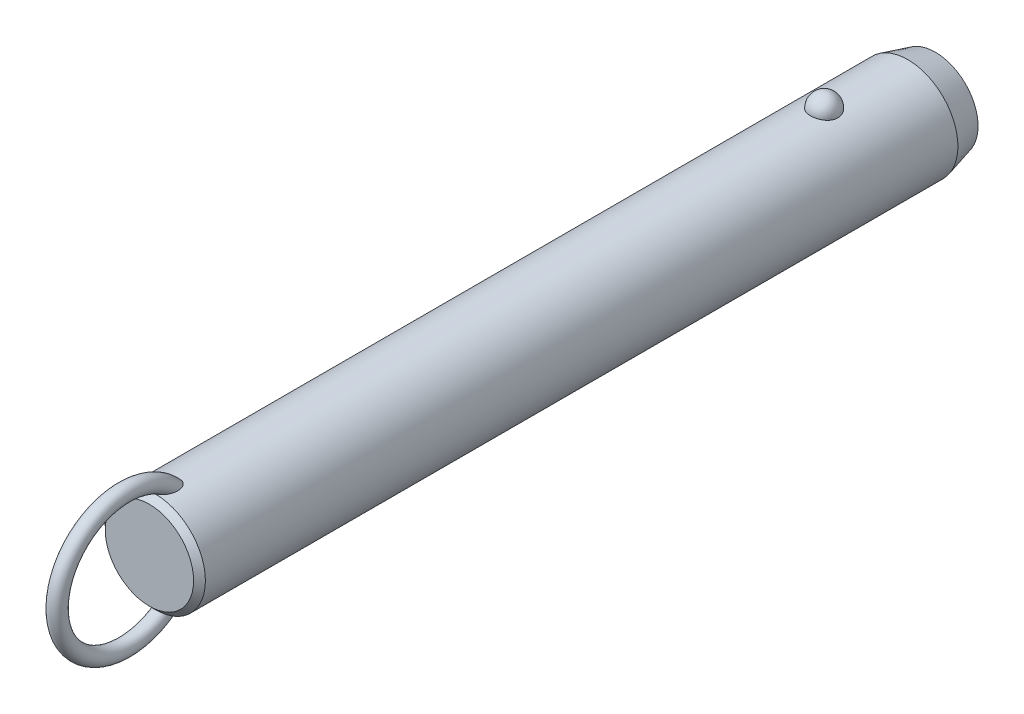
ISO-10303-21;
HEADER;
FILE_DESCRIPTION(('STEP AP214'),'2;1');
FILE_NAME('part.step','',(''),(''),'','','');
FILE_SCHEMA(('AUTOMOTIVE_DESIGN { 1 0 10303 214 1 1 1 1 }'));
ENDSEC;
DATA;
#1=APPLICATION_CONTEXT('core data for automotive mechanical design processes');
#2=APPLICATION_PROTOCOL_DEFINITION('international standard','automotive_design',2000,#1);
#3=PRODUCT_CONTEXT('',#1,'mechanical');
#4=PRODUCT('Part','Part','',(#3));
#5=PRODUCT_RELATED_PRODUCT_CATEGORY('part','',(#4));
#6=PRODUCT_DEFINITION_FORMATION('','',#4);
#7=PRODUCT_DEFINITION_CONTEXT('part definition',#1,'design');
#8=PRODUCT_DEFINITION('design','',#6,#7);
#9=PRODUCT_DEFINITION_SHAPE('','',#8);
#10=(LENGTH_UNIT() NAMED_UNIT(*) SI_UNIT(.MILLI.,.METRE.));
#11=(NAMED_UNIT(*) PLANE_ANGLE_UNIT() SI_UNIT($,.RADIAN.));
#12=(NAMED_UNIT(*) SI_UNIT($,.STERADIAN.) SOLID_ANGLE_UNIT());
#13=UNCERTAINTY_MEASURE_WITH_UNIT(LENGTH_MEASURE(1.E-05),#10,'distance_accuracy_value','');
#14=(GEOMETRIC_REPRESENTATION_CONTEXT(3) GLOBAL_UNCERTAINTY_ASSIGNED_CONTEXT((#13)) GLOBAL_UNIT_ASSIGNED_CONTEXT((#10,
#11,#12)) REPRESENTATION_CONTEXT('',''));
#15=CARTESIAN_POINT('',(0.,0.,0.));
#16=DIRECTION('',(0.,0.,1.));
#17=DIRECTION('',(1.,0.,0.));
#18=AXIS2_PLACEMENT_3D('',#15,#16,#17);
#19=CARTESIAN_POINT('',(0.,0.,154.9));
#20=DIRECTION('',(0.,0.,-1.));
#21=DIRECTION('',(-1.,0.,0.));
#22=AXIS2_PLACEMENT_3D('',#19,#20,#21);
#23=CYLINDRICAL_SURFACE('',#22,12.7);
#24=CARTESIAN_POINT('',(3.46661256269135,12.2177165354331,-3.50000000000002));
#25=CARTESIAN_POINT('',(3.4666090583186,12.2177194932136,-3.30432790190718));
#26=CARTESIAN_POINT('',(3.45063567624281,12.2222841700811,-3.10861112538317));
#27=CARTESIAN_POINT('',(3.38712451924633,12.2400345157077,-2.72271899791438));
#28=CARTESIAN_POINT('',(3.33957415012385,12.2532236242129,-2.53254588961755));
#29=CARTESIAN_POINT('',(3.2141234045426,12.286724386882,-2.16324948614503));
#30=CARTESIAN_POINT('',(3.13623639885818,12.3070329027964,-1.98412136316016));
#31=CARTESIAN_POINT('',(2.95205930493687,12.3525018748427,-1.6418059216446));
#32=CARTESIAN_POINT('',(2.84577003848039,12.3776621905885,-1.47861814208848));
#33=CARTESIAN_POINT('',(2.60688050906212,12.4301712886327,-1.17190583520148));
#34=CARTESIAN_POINT('',(2.47415697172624,12.4575299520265,-1.0284789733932));
#35=CARTESIAN_POINT('',(2.18615174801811,12.5112810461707,-0.766177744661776));
#36=CARTESIAN_POINT('',(2.03087002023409,12.5376734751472,-0.647303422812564));
#37=CARTESIAN_POINT('',(1.70237334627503,12.5864761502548,-0.437732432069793));
#38=CARTESIAN_POINT('',(1.52920948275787,12.6088972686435,-0.346958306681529));
#39=CARTESIAN_POINT('',(1.16944170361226,12.6473352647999,-0.195750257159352));
#40=CARTESIAN_POINT('',(0.982839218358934,12.663352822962,-0.135313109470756));
#41=CARTESIAN_POINT('',(0.604961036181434,12.6869706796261,-0.0473241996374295));
#42=CARTESIAN_POINT('',(0.41382314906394,12.6947125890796,-0.0192185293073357));
#43=CARTESIAN_POINT('',(0.0293827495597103,12.7014203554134,0.00517254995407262));
#44=CARTESIAN_POINT('',(-0.163919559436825,12.7003870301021,0.00146092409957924));
#45=CARTESIAN_POINT('',(-0.544374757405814,12.689735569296,-0.0373939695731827));
#46=CARTESIAN_POINT('',(-0.731575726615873,12.6802364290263,-0.0721015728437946));
#47=CARTESIAN_POINT('',(-1.09733277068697,12.6538333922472,-0.171364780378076));
#48=CARTESIAN_POINT('',(-1.27588869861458,12.6369293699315,-0.235920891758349));
#49=CARTESIAN_POINT('',(-1.6204698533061,12.5973946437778,-0.393548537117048));
#50=CARTESIAN_POINT('',(-1.78641865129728,12.5747321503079,-0.486778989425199));
#51=CARTESIAN_POINT('',(-2.10030671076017,12.5261316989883,-0.699110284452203));
#52=CARTESIAN_POINT('',(-2.24824419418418,12.5001934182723,-0.818213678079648));
#53=CARTESIAN_POINT('',(-2.52491489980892,12.4472906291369,-1.0815712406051));
#54=CARTESIAN_POINT('',(-2.65324222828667,12.4203160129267,-1.22624992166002));
#55=CARTESIAN_POINT('',(-2.88410007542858,12.3687509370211,-1.53528325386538));
#56=CARTESIAN_POINT('',(-2.98662883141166,12.3441606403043,-1.69963924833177));
#57=CARTESIAN_POINT('',(-3.16432417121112,12.2998199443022,-2.04548497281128));
#58=CARTESIAN_POINT('',(-3.23917525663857,12.2801261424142,-2.22714424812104));
#59=CARTESIAN_POINT('',(-3.35800573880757,12.248167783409,-2.60091389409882));
#60=CARTESIAN_POINT('',(-3.4019860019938,12.2359030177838,-2.79302397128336));
#61=CARTESIAN_POINT('',(-3.45784812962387,12.2202347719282,-3.18140279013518));
#62=CARTESIAN_POINT('',(-3.46986123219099,12.2167950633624,-3.37765118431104));
#63=CARTESIAN_POINT('',(-3.46186273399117,12.2190638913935,-3.76943689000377));
#64=CARTESIAN_POINT('',(-3.44185196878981,12.2247721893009,-3.96497421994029));
#65=CARTESIAN_POINT('',(-3.37048652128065,12.2446381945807,-4.34881728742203));
#66=CARTESIAN_POINT('',(-3.31928253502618,12.2587552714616,-4.53715319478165));
#67=CARTESIAN_POINT('',(-3.18693461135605,12.2938237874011,-4.9023172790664));
#68=CARTESIAN_POINT('',(-3.1057895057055,12.3147754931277,-5.07914500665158));
#69=CARTESIAN_POINT('',(-2.91506431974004,12.3613125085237,-5.41732059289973));
#70=CARTESIAN_POINT('',(-2.80533587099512,12.3869217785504,-5.57858147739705));
#71=CARTESIAN_POINT('',(-2.560414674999,12.4398525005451,-5.88013283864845));
#72=CARTESIAN_POINT('',(-2.42522099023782,12.4671740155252,-6.02042254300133));
#73=CARTESIAN_POINT('',(-2.1323357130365,12.5205965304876,-6.27662798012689));
#74=CARTESIAN_POINT('',(-1.97456596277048,12.5466928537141,-6.39245542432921));
#75=CARTESIAN_POINT('',(-1.64115839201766,12.5946384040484,-6.59583547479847));
#76=CARTESIAN_POINT('',(-1.46552179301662,12.6164879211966,-6.68339001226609));
#77=CARTESIAN_POINT('',(-1.10356050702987,12.6532533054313,-6.82682153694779));
#78=CARTESIAN_POINT('',(-0.9173913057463,12.6682500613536,-6.88306988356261));
#79=CARTESIAN_POINT('',(-0.537836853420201,12.6900288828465,-6.96386887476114));
#80=CARTESIAN_POINT('',(-0.344452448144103,12.6968119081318,-6.98842322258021));
#81=CARTESIAN_POINT('',(0.0402577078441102,12.7013667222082,-7.00496469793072));
#82=CARTESIAN_POINT('',(0.231556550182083,12.6993008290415,-6.99753844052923));
#83=CARTESIAN_POINT('',(0.610105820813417,12.6867505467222,-6.95166366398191));
#84=CARTESIAN_POINT('',(0.797356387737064,12.6762664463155,-6.91321620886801));
#85=CARTESIAN_POINT('',(1.16186657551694,12.6480587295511,-6.80658431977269));
#86=CARTESIAN_POINT('',(1.33915951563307,12.6303611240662,-6.73850666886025));
#87=CARTESIAN_POINT('',(1.67968518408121,12.5896027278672,-6.57450875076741));
#88=CARTESIAN_POINT('',(1.84291705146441,12.5665416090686,-6.47858678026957));
#89=CARTESIAN_POINT('',(2.15340192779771,12.5171072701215,-6.25982455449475));
#90=CARTESIAN_POINT('',(2.30037831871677,12.4906895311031,-6.13660186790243));
#91=CARTESIAN_POINT('',(2.5717412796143,12.4376567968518,-5.86739587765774));
#92=CARTESIAN_POINT('',(2.69612388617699,12.4110417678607,-5.72140858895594));
#93=CARTESIAN_POINT('',(2.92107785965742,12.360051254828,-5.40794137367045));
#94=CARTESIAN_POINT('',(3.02121329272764,12.3357209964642,-5.24014110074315));
#95=CARTESIAN_POINT('',(3.19236291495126,12.2925446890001,-4.88969865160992));
#96=CARTESIAN_POINT('',(3.26338839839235,12.2736965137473,-4.70706226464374));
#97=CARTESIAN_POINT('',(3.36788038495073,12.245404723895,-4.35469510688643));
#98=CARTESIAN_POINT('',(3.40484026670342,12.2351018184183,-4.18605935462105));
#99=CARTESIAN_POINT('',(3.45420764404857,12.2212564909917,-3.84496058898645));
#100=CARTESIAN_POINT('',(3.46661565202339,12.2177139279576,-3.67249765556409));
#101=CARTESIAN_POINT('',(3.46661256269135,12.2177165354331,-3.50000000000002));
#102=B_SPLINE_CURVE_WITH_KNOTS('',3,(#24,#25,#26,#27,#28,#29,#30,#31,#32,#33,#34,#35,#36,#37,
#38,#39,#40,#41,#42,#43,#44,#45,#46,#47,#48,#49,#50,#51,#52,#53,#54,#55,#56,#57,#58,#59,#60,#61,
#62,#63,#64,#65,#66,#67,#68,#69,#70,#71,#72,#73,#74,#75,#76,#77,#78,#79,#80,#81,#82,#83,#84,#85,
#86,#87,#88,#89,#90,#91,#92,#93,#94,#95,#96,#97,#98,#99,#100,#101),.UNSPECIFIED.,.T.,.F.,(4,2,2,
2,2,2,2,2,2,2,2,2,2,2,2,2,2,2,2,2,2,2,2,2,2,2,2,2,2,2,2,2,2,2,2,2,2,2,4),(0.,0.586396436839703,
1.17302689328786,1.7593990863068,2.34575431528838,2.93491084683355,3.52406845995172,
4.11158733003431,4.69904375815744,5.2762784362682,5.85345931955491,6.42265312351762,
6.99185659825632,7.56427334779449,8.136746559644,8.71981013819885,9.3029135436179,
9.89247258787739,10.4820150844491,11.0691335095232,11.6562366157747,12.2405256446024,
12.8248374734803,13.412244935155,13.9996740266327,14.5891883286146,15.1786623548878,
15.7609861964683,16.3432419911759,16.9148635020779,17.4864654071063,18.0560241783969,
18.6256177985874,19.2037609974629,19.7820055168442,20.3699810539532,20.957728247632,
21.4746855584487,21.9916320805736),.UNSPECIFIED.);
#103=CARTESIAN_POINT('',(3.46661256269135,12.2177165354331,-3.50000000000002));
#104=VERTEX_POINT('',#103);
#105=EDGE_CURVE('E41',#104,#104,#102,.T.);
#106=ORIENTED_EDGE('',*,*,#105,.T.);
#107=EDGE_LOOP('',(#106));
#108=FACE_BOUND('',#107,.T.);
#109=CARTESIAN_POINT('',(0.,0.,166.1));
#110=DIRECTION('',(0.,0.,1.));
#111=DIRECTION('',(1.,0.,0.));
#112=AXIS2_PLACEMENT_3D('',#109,#110,#111);
#113=CIRCLE('',#112,12.7);
#114=CARTESIAN_POINT('',(12.7,0.,166.1));
#115=VERTEX_POINT('',#114);
#116=EDGE_CURVE('E10',#115,#115,#113,.F.);
#117=ORIENTED_EDGE('',*,*,#116,.T.);
#118=EDGE_LOOP('',(#117));
#119=FACE_BOUND('',#118,.T.);
#120=CARTESIAN_POINT('',(-0.548122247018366,-12.6881662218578,159.843218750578));
#121=CARTESIAN_POINT('',(-0.648865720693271,-12.6838128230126,159.877926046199));
#122=CARTESIAN_POINT('',(-0.746398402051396,-12.6783867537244,159.922042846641));
#123=CARTESIAN_POINT('',(-0.932125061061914,-12.666091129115,160.026764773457));
#124=CARTESIAN_POINT('',(-1.02030388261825,-12.6592192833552,160.087396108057));
#125=CARTESIAN_POINT('',(-1.18487740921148,-12.6448747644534,160.221847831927));
#126=CARTESIAN_POINT('',(-1.26134296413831,-12.637406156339,160.295582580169));
#127=CARTESIAN_POINT('',(-1.4023120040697,-12.6225412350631,160.453604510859));
#128=CARTESIAN_POINT('',(-1.466814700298,-12.6151449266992,160.53789238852));
#129=CARTESIAN_POINT('',(-1.60714786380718,-12.5981718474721,160.749657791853));
#130=CARTESIAN_POINT('',(-1.67725126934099,-12.588900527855,160.880962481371));
#131=CARTESIAN_POINT('',(-1.79536591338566,-12.5725964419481,161.153247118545));
#132=CARTESIAN_POINT('',(-1.84333535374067,-12.5655679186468,161.294244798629));
#133=CARTESIAN_POINT('',(-1.93422576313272,-12.5519624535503,161.637645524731));
#134=CARTESIAN_POINT('',(-1.96788773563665,-12.5466298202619,161.842557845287));
#135=CARTESIAN_POINT('',(-1.9941399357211,-12.542463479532,162.151760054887));
#136=CARTESIAN_POINT('',(-1.99883864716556,-12.5417153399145,162.255298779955));
#137=CARTESIAN_POINT('',(-2.00078003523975,-12.5414074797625,162.46245124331));
#138=CARTESIAN_POINT('',(-1.99802449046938,-12.5418474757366,162.566064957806));
#139=CARTESIAN_POINT('',(-1.98336733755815,-12.5441750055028,162.81032076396));
#140=CARTESIAN_POINT('',(-1.96851430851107,-12.5465291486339,162.950780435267));
#141=CARTESIAN_POINT('',(-1.92707089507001,-12.5529612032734,163.229960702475));
#142=CARTESIAN_POINT('',(-1.90047458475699,-12.5570399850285,163.368680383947));
#143=CARTESIAN_POINT('',(-1.83619120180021,-12.5666008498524,163.64341135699));
#144=CARTESIAN_POINT('',(-1.79850828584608,-12.57208240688,163.779423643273));
#145=CARTESIAN_POINT('',(-1.71223796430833,-12.5841228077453,164.047842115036));
#146=CARTESIAN_POINT('',(-1.66365679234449,-12.5906810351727,164.180250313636));
#147=CARTESIAN_POINT('',(-1.57804503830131,-12.6016176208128,164.38548877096));
#148=CARTESIAN_POINT('',(-1.54477252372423,-12.6057501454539,164.459914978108));
#149=CARTESIAN_POINT('',(-1.47424480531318,-12.6141930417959,164.606839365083));
#150=CARTESIAN_POINT('',(-1.43699041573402,-12.6185033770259,164.679337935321));
#151=CARTESIAN_POINT('',(-1.35825795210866,-12.6272207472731,164.821892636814));
#152=CARTESIAN_POINT('',(-1.31678520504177,-12.6316276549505,164.891951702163));
#153=CARTESIAN_POINT('',(-1.22917793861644,-12.6404532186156,165.029070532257));
#154=CARTESIAN_POINT('',(-1.18304514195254,-12.6448718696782,165.096131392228));
#155=CARTESIAN_POINT('',(-1.07246411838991,-12.6547893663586,165.243874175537));
#156=CARTESIAN_POINT('',(-1.0064223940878,-12.6602600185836,165.323384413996));
#157=CARTESIAN_POINT('',(-0.864441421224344,-12.6707460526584,165.473169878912));
#158=CARTESIAN_POINT('',(-0.788516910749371,-12.6757620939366,165.543458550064));
#159=CARTESIAN_POINT('',(-0.652215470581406,-12.6833591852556,165.648680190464));
#160=CARTESIAN_POINT('',(-0.594982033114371,-12.6861973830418,165.687624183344));
#161=CARTESIAN_POINT('',(-0.475269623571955,-12.6912445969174,165.756489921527));
#162=CARTESIAN_POINT('',(-0.412800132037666,-12.6934547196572,165.786427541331));
#163=CARTESIAN_POINT('',(-0.295749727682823,-12.6966636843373,165.829756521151));
#164=CARTESIAN_POINT('',(-0.241949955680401,-12.6978134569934,165.845218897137));
#165=CARTESIAN_POINT('',(-0.132508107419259,-12.6994261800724,165.866884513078));
#166=CARTESIAN_POINT('',(-0.0768679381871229,-12.6998898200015,165.873097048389));
#167=CARTESIAN_POINT('',(0.0347696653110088,-12.7000752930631,165.875583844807));
#168=CARTESIAN_POINT('',(0.0907676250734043,-12.6997954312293,165.871835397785));
#169=CARTESIAN_POINT('',(0.201283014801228,-12.6985255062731,165.854788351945));
#170=CARTESIAN_POINT('',(0.255799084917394,-12.6975348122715,165.841481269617));
#171=CARTESIAN_POINT('',(0.376042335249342,-12.6946091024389,165.80203792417));
#172=CARTESIAN_POINT('',(0.440950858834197,-12.6924943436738,165.773449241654));
#173=CARTESIAN_POINT('',(0.56535027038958,-12.6875639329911,165.706323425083));
#174=CARTESIAN_POINT('',(0.624828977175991,-12.6847467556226,165.667764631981));
#175=CARTESIAN_POINT('',(0.774116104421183,-12.6767252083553,165.556949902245));
#176=CARTESIAN_POINT('',(0.859449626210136,-12.6711344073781,165.478760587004));
#177=CARTESIAN_POINT('',(1.01789440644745,-12.6593922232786,165.310943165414));
#178=CARTESIAN_POINT('',(1.09096902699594,-12.653239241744,165.221282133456));
#179=CARTESIAN_POINT('',(1.22268793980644,-12.6411674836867,165.040265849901));
#180=CARTESIAN_POINT('',(1.28193986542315,-12.6352572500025,164.949345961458));
#181=CARTESIAN_POINT('',(1.39259777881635,-12.6235401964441,164.762792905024));
#182=CARTESIAN_POINT('',(1.44399707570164,-12.6177334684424,164.667155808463));
#183=CARTESIAN_POINT('',(1.53972870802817,-12.6064093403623,164.472273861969));
#184=CARTESIAN_POINT('',(1.58405262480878,-12.6008922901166,164.373024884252));
#185=CARTESIAN_POINT('',(1.66600705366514,-12.5903187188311,164.171772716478));
#186=CARTESIAN_POINT('',(1.70363651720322,-12.5852622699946,164.069769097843));
#187=CARTESIAN_POINT('',(1.77545379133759,-12.5753406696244,163.854358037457));
#188=CARTESIAN_POINT('',(1.80903453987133,-12.5705328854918,163.740745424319));
#189=CARTESIAN_POINT('',(1.86844163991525,-12.5618400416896,163.511457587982));
#190=CARTESIAN_POINT('',(1.89426665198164,-12.5579551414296,163.395782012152));
#191=CARTESIAN_POINT('',(1.93785464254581,-12.5513030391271,163.163007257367));
#192=CARTESIAN_POINT('',(1.95562640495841,-12.5485346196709,163.045909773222));
#193=CARTESIAN_POINT('',(1.98264463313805,-12.5442934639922,162.810747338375));
#194=CARTESIAN_POINT('',(1.99189298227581,-12.5428204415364,162.69268260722));
#195=CARTESIAN_POINT('',(2.00416068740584,-12.540871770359,162.380622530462));
#196=CARTESIAN_POINT('',(1.99944433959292,-12.541631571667,162.186229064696));
#197=CARTESIAN_POINT('',(1.96113755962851,-12.5476846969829,161.800309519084));
#198=CARTESIAN_POINT('',(1.92758341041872,-12.5529723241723,161.608780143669));
#199=CARTESIAN_POINT('',(1.83934342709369,-12.5661532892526,161.282272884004));
#200=CARTESIAN_POINT('',(1.79215440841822,-12.5730485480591,161.14524997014));
#201=CARTESIAN_POINT('',(1.67676242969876,-12.588958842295,160.880445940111));
#202=CARTESIAN_POINT('',(1.60859050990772,-12.597970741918,160.752651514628));
#203=CARTESIAN_POINT('',(1.46583832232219,-12.6152829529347,160.535800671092));
#204=CARTESIAN_POINT('',(1.39525727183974,-12.6233659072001,160.44410500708));
#205=CARTESIAN_POINT('',(1.23992594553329,-12.6395676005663,160.273485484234));
#206=CARTESIAN_POINT('',(1.15517932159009,-12.6476863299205,160.194558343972));
#207=CARTESIAN_POINT('',(0.971995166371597,-12.6630846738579,160.052643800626));
#208=CARTESIAN_POINT('',(0.873456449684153,-12.6703572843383,159.989784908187));
#209=CARTESIAN_POINT('',(0.665847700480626,-12.6829569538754,159.884487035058));
#210=CARTESIAN_POINT('',(0.556784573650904,-12.688285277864,159.842034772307));
#211=CARTESIAN_POINT('',(0.347338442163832,-12.6956226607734,159.784443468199));
#212=CARTESIAN_POINT('',(0.24775974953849,-12.6979816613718,159.766399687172));
#213=CARTESIAN_POINT('',(0.0470218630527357,-12.7003077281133,159.748600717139));
#214=CARTESIAN_POINT('',(-0.0541350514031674,-12.7002779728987,159.748821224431));
#215=CARTESIAN_POINT('',(-0.221414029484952,-12.6982482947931,159.764363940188));
#216=CARTESIAN_POINT('',(-0.288055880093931,-12.6969033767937,159.774666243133));
#217=CARTESIAN_POINT('',(-0.419599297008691,-12.6932369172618,159.80313489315));
#218=CARTESIAN_POINT('',(-0.484501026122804,-12.6909154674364,159.821300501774));
#219=CARTESIAN_POINT('',(-0.548122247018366,-12.6881662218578,159.843218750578));
#220=B_SPLINE_CURVE_WITH_KNOTS('',3,(#120,#121,#122,#123,#124,#125,#126,#127,#128,#129,#130,
#131,#132,#133,#134,#135,#136,#137,#138,#139,#140,#141,#142,#143,#144,#145,#146,#147,#148,#149,
#150,#151,#152,#153,#154,#155,#156,#157,#158,#159,#160,#161,#162,#163,#164,#165,#166,#167,#168,
#169,#170,#171,#172,#173,#174,#175,#176,#177,#178,#179,#180,#181,#182,#183,#184,#185,#186,#187,
#188,#189,#190,#191,#192,#193,#194,#195,#196,#197,#198,#199,#200,#201,#202,#203,#204,#205,#206,
#207,#208,#209,#210,#211,#212,#213,#214,#215,#216,#217,#218,#219),.UNSPECIFIED.,.T.,.F.,(4,2,2,
2,2,2,2,2,2,2,2,2,2,2,2,2,2,2,2,2,2,2,2,2,2,2,2,2,2,2,2,2,2,2,2,2,2,2,2,2,2,2,2,2,2,2,2,2,2,4),
(0.,0.31964225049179,0.639794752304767,0.957927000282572,1.27608021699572,1.72100165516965,
2.16675988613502,2.78630021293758,3.09705782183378,3.40774128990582,3.83096358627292,
4.25439969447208,4.67767724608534,5.1007133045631,5.34550297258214,5.59024267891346,
5.83467707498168,6.07902143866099,6.38891080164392,6.69834321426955,6.90560910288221,
7.11250749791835,7.27977315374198,7.44687060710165,7.61434932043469,7.78197685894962,
7.99365544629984,8.20579780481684,8.55147335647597,8.89816429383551,9.22375138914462,
9.54961437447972,9.87586224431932,10.202161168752,10.5575872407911,10.9130746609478,
11.2681734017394,11.6231936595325,12.2046601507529,12.7853961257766,13.219164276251,
13.6522938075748,13.9989174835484,14.3454519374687,14.6946768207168,15.0436740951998,
15.3457513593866,15.6474266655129,15.8493051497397,16.0511646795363),.UNSPECIFIED.);
#221=CARTESIAN_POINT('',(-0.548122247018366,-12.6881662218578,159.843218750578));
#222=VERTEX_POINT('',#221);
#223=EDGE_CURVE('E60',#222,#222,#220,.T.);
#224=ORIENTED_EDGE('',*,*,#223,.T.);
#225=EDGE_LOOP('',(#224));
#226=FACE_BOUND('',#225,.T.);
#227=CARTESIAN_POINT('',(-0.548122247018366,12.6881662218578,159.843218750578));
#228=CARTESIAN_POINT('',(-0.459436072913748,12.6919968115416,159.812673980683));
#229=CARTESIAN_POINT('',(-0.368189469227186,12.6949996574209,159.789391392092));
#230=CARTESIAN_POINT('',(-0.183024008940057,12.6990186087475,159.758406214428));
#231=CARTESIAN_POINT('',(-0.089104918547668,12.7000345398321,159.750704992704));
#232=CARTESIAN_POINT('',(0.0987147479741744,12.6999636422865,159.751245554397));
#233=CARTESIAN_POINT('',(0.192615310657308,12.6988761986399,159.759492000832));
#234=CARTESIAN_POINT('',(0.377658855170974,12.6947211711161,159.791551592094));
#235=CARTESIAN_POINT('',(0.468801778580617,12.6916535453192,159.815365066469));
#236=CARTESIAN_POINT('',(0.645809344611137,12.6838788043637,159.87745651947));
#237=CARTESIAN_POINT('',(0.731679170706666,12.6791733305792,159.915720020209));
#238=CARTESIAN_POINT('',(0.896315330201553,12.6686004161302,160.005120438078));
#239=CARTESIAN_POINT('',(0.97508059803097,12.6627328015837,160.056259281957));
#240=CARTESIAN_POINT('',(1.12963655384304,12.6499161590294,160.17367820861));
#241=CARTESIAN_POINT('',(1.20478673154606,12.6429194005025,160.240792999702));
#242=CARTESIAN_POINT('',(1.34448241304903,12.6288282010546,160.38522507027));
#243=CARTESIAN_POINT('',(1.40902173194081,12.621733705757,160.462548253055));
#244=CARTESIAN_POINT('',(1.55208211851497,12.6050877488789,160.659247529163));
#245=CARTESIAN_POINT('',(1.62510490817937,12.5957546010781,160.782654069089));
#246=CARTESIAN_POINT('',(1.7501904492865,12.5789823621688,161.039769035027));
#247=CARTESIAN_POINT('',(1.8022137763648,12.5715468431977,161.173496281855));
#248=CARTESIAN_POINT('',(1.90309965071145,12.5567434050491,161.498351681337));
#249=CARTESIAN_POINT('',(1.94342317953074,12.5504515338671,161.692161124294));
#250=CARTESIAN_POINT('',(1.99332997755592,12.5426147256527,162.08378810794));
#251=CARTESIAN_POINT('',(2.00285305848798,12.5410790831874,162.281612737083));
#252=CARTESIAN_POINT('',(1.99678999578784,12.5420407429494,162.616642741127));
#253=CARTESIAN_POINT('',(1.98794117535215,12.5434564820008,162.754042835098));
#254=CARTESIAN_POINT('',(1.95865119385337,12.5480641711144,163.027639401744));
#255=CARTESIAN_POINT('',(1.93820436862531,12.5512569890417,163.163835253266));
#256=CARTESIAN_POINT('',(1.88647896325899,12.5591352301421,163.434249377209));
#257=CARTESIAN_POINT('',(1.85518800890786,12.5638223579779,163.568465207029));
#258=CARTESIAN_POINT('',(1.78217886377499,12.5743868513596,163.833936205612));
#259=CARTESIAN_POINT('',(1.74046509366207,12.5802637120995,163.965192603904));
#260=CARTESIAN_POINT('',(1.66024095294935,12.5910571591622,164.186085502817));
#261=CARTESIAN_POINT('',(1.62434772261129,12.5957535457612,164.276690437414));
#262=CARTESIAN_POINT('',(1.54709009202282,12.6054762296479,164.455512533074));
#263=CARTESIAN_POINT('',(1.50572681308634,12.6105024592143,164.543730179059));
#264=CARTESIAN_POINT('',(1.41728020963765,12.620748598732,164.716932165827));
#265=CARTESIAN_POINT('',(1.37021377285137,12.625967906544,164.801925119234));
#266=CARTESIAN_POINT('',(1.26969620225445,12.6364721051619,164.968007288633));
#267=CARTESIAN_POINT('',(1.21624929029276,12.6417569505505,165.049099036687));
#268=CARTESIAN_POINT('',(1.1030441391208,12.6521331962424,165.204702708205));
#269=CARTESIAN_POINT('',(1.04340936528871,12.657226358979,165.279303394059));
#270=CARTESIAN_POINT('',(0.915919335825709,12.667090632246,165.421324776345));
#271=CARTESIAN_POINT('',(0.848064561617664,12.6718617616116,165.48874589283));
#272=CARTESIAN_POINT('',(0.717035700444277,12.67987711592,165.600624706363));
#273=CARTESIAN_POINT('',(0.655526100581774,12.6832377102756,165.646997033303));
#274=CARTESIAN_POINT('',(0.525985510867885,12.6892676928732,165.729619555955));
#275=CARTESIAN_POINT('',(0.457969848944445,12.6919386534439,165.765892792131));
#276=CARTESIAN_POINT('',(0.334859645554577,12.695691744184,165.816657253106));
#277=CARTESIAN_POINT('',(0.281116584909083,12.6970073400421,165.834373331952));
#278=CARTESIAN_POINT('',(0.171425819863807,12.6989609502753,165.860642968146));
#279=CARTESIAN_POINT('',(0.115480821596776,12.699599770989,165.869207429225));
#280=CARTESIAN_POINT('',(0.00272618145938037,12.7001251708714,165.876253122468));
#281=CARTESIAN_POINT('',(-0.0540859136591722,12.7000089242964,165.874696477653));
#282=CARTESIAN_POINT('',(-0.16654462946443,12.6990328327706,165.861600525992));
#283=CARTESIAN_POINT('',(-0.222190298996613,12.6981724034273,165.850053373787));
#284=CARTESIAN_POINT('',(-0.342018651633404,12.695562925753,165.814912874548));
#285=CARTESIAN_POINT('',(-0.405606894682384,12.6936676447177,165.78933225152));
#286=CARTESIAN_POINT('',(-0.527815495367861,12.6891754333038,165.728311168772));
#287=CARTESIAN_POINT('',(-0.586425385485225,12.6865770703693,165.692850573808));
#288=CARTESIAN_POINT('',(-0.731842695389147,12.6792129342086,165.591496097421));
#289=CARTESIAN_POINT('',(-0.814709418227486,12.6740767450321,165.5200395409));
#290=CARTESIAN_POINT('',(-0.969101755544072,12.6632083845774,165.36589007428));
#291=CARTESIAN_POINT('',(-1.04059564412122,12.6574746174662,165.283166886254));
#292=CARTESIAN_POINT('',(-1.16981116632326,12.6461638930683,165.115809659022));
#293=CARTESIAN_POINT('',(-1.22811369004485,12.6405994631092,165.031616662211));
#294=CARTESIAN_POINT('',(-1.33743405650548,12.6295007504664,164.858579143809));
#295=CARTESIAN_POINT('',(-1.38844577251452,12.6239664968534,164.769730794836));
#296=CARTESIAN_POINT('',(-1.48400702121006,12.6130898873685,164.588389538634));
#297=CARTESIAN_POINT('',(-1.52854232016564,12.6077479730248,164.495889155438));
#298=CARTESIAN_POINT('',(-1.61150113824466,12.5974127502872,164.308160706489));
#299=CARTESIAN_POINT('',(-1.64992317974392,12.5924195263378,164.212931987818));
#300=CARTESIAN_POINT('',(-1.73468589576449,12.581070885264,163.98289362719));
#301=CARTESIAN_POINT('',(-1.77831261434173,12.5749388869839,163.847066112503));
#302=CARTESIAN_POINT('',(-1.85439734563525,12.5639437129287,163.572212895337));
#303=CARTESIAN_POINT('',(-1.88684994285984,12.5590811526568,163.433185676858));
#304=CARTESIAN_POINT('',(-1.94008483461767,12.550968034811,163.15309235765));
#305=CARTESIAN_POINT('',(-1.96088706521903,12.5477147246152,163.012030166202));
#306=CARTESIAN_POINT('',(-1.99000539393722,12.5431291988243,162.728668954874));
#307=CARTESIAN_POINT('',(-1.99832911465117,12.5417958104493,162.586370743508));
#308=CARTESIAN_POINT('',(-2.00166624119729,12.5412674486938,162.257627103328));
#309=CARTESIAN_POINT('',(-1.99178843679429,12.5428579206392,162.071088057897));
#310=CARTESIAN_POINT('',(-1.94455183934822,12.5502731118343,161.70162404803));
#311=CARTESIAN_POINT('',(-1.90724032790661,12.5560905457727,161.518693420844));
#312=CARTESIAN_POINT('',(-1.81330718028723,12.5699462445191,161.204848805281));
#313=CARTESIAN_POINT('',(-1.76338820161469,12.5771273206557,161.071910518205));
#314=CARTESIAN_POINT('',(-1.64305018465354,12.593414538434,160.815681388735));
#315=CARTESIAN_POINT('',(-1.57265346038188,12.6025185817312,160.692380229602));
#316=CARTESIAN_POINT('',(-1.42634956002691,12.6198178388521,160.483564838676));
#317=CARTESIAN_POINT('',(-1.35423772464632,12.6278405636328,160.395384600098));
#318=CARTESIAN_POINT('',(-1.19645664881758,12.6437632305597,160.232107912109));
#319=CARTESIAN_POINT('',(-1.1108053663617,12.6516633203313,160.156994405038));
#320=CARTESIAN_POINT('',(-0.947219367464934,12.6648319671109,160.037811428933));
#321=CARTESIAN_POINT('',(-0.871624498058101,12.670300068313,159.990541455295));
#322=CARTESIAN_POINT('',(-0.714161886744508,12.6801492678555,159.9077413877));
#323=CARTESIAN_POINT('',(-0.632295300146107,12.684530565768,159.87220913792));
#324=CARTESIAN_POINT('',(-0.548122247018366,12.6881662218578,159.843218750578));
#325=B_SPLINE_CURVE_WITH_KNOTS('',3,(#227,#228,#229,#230,#231,#232,#233,#234,#235,#236,#237,
#238,#239,#240,#241,#242,#243,#244,#245,#246,#247,#248,#249,#250,#251,#252,#253,#254,#255,#256,
#257,#258,#259,#260,#261,#262,#263,#264,#265,#266,#267,#268,#269,#270,#271,#272,#273,#274,#275,
#276,#277,#278,#279,#280,#281,#282,#283,#284,#285,#286,#287,#288,#289,#290,#291,#292,#293,#294,
#295,#296,#297,#298,#299,#300,#301,#302,#303,#304,#305,#306,#307,#308,#309,#310,#311,#312,#313,
#314,#315,#316,#317,#318,#319,#320,#321,#322,#323,#324),.UNSPECIFIED.,.T.,.F.,(4,2,2,2,2,2,2,2,
2,2,2,2,2,2,2,2,2,2,2,2,2,2,2,2,2,2,2,2,2,2,2,2,2,2,2,2,2,2,2,2,2,2,2,2,2,2,2,2,4),(0.,
0.281328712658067,0.562682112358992,0.844117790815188,1.12555942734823,1.40671982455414,
1.68792232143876,1.98972294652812,2.29169886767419,2.72039860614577,3.14989948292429,
3.74084916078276,4.33295293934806,4.74554109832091,5.15833092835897,5.57159335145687,
5.98468079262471,6.27722775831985,6.56971484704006,6.86135609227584,7.15280542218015,
7.43927407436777,7.72572595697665,7.95635862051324,8.18646071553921,8.35559393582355,
8.52452541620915,8.69408946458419,8.86378678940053,9.06834348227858,9.27332014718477,
9.6001041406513,9.92778432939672,10.2350252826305,10.5425229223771,10.8506864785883,
11.15892440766,11.5867893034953,12.0148612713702,12.4421984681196,12.8692745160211,
13.4279365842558,13.9856380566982,14.4107062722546,14.835313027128,15.1765567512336,
15.517351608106,15.7844129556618,16.051425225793),.UNSPECIFIED.);
#326=CARTESIAN_POINT('',(-0.548122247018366,12.6881662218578,159.843218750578));
#327=VERTEX_POINT('',#326);
#328=EDGE_CURVE('E67',#327,#327,#325,.T.);
#329=ORIENTED_EDGE('',*,*,#328,.T.);
#330=EDGE_LOOP('',(#329));
#331=FACE_BOUND('',#330,.T.);
#332=CARTESIAN_POINT('',(0.,0.,-24.6999999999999));
#333=DIRECTION('',(0.,0.,-1.));
#334=DIRECTION('',(-1.,0.,0.));
#335=AXIS2_PLACEMENT_3D('',#332,#333,#334);
#336=CIRCLE('',#335,12.7);
#337=CARTESIAN_POINT('',(-12.7,0.,-24.6999999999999));
#338=VERTEX_POINT('',#337);
#339=EDGE_CURVE('E57',#338,#338,#336,.F.);
#340=ORIENTED_EDGE('',*,*,#339,.T.);
#341=EDGE_LOOP('',(#340));
#342=FACE_BOUND('',#341,.T.);
#343=ADVANCED_FACE('F37',(#108,#119,#226,#331,#342),#23,.T.);
#344=CARTESIAN_POINT('',(0.,0.,-31.7));
#345=DIRECTION('',(0.,0.,-1.));
#346=DIRECTION('',(-1.,0.,0.));
#347=AXIS2_PLACEMENT_3D('',#344,#345,#346);
#348=PLANE('',#347);
#349=CARTESIAN_POINT('',(0.,0.,-31.7));
#350=DIRECTION('',(0.,0.,-1.));
#351=DIRECTION('',(-1.,0.,0.));
#352=AXIS2_PLACEMENT_3D('',#349,#350,#351);
#353=CIRCLE('',#352,10.8243556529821);
#354=CARTESIAN_POINT('',(-10.8243556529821,0.,-31.7));
#355=VERTEX_POINT('',#354);
#356=EDGE_CURVE('E66',#355,#355,#353,.T.);
#357=ORIENTED_EDGE('',*,*,#356,.T.);
#358=EDGE_LOOP('',(#357));
#359=FACE_BOUND('',#358,.T.);
#360=ADVANCED_FACE('F85',(#359),#348,.T.);
#361=CARTESIAN_POINT('',(0.,0.,-31.7));
#362=DIRECTION('',(0.,0.,1.));
#363=DIRECTION('',(1.,0.,0.));
#364=AXIS2_PLACEMENT_3D('',#361,#362,#363);
#365=CONICAL_SURFACE('',#364,10.8243556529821,0.261799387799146);
#366=ORIENTED_EDGE('',*,*,#339,.F.);
#367=EDGE_LOOP('',(#366));
#368=FACE_BOUND('',#367,.T.);
#369=ORIENTED_EDGE('',*,*,#356,.F.);
#370=EDGE_LOOP('',(#369));
#371=FACE_BOUND('',#370,.T.);
#372=ADVANCED_FACE('F83',(#368,#371),#365,.T.);
#373=CARTESIAN_POINT('',(0.,0.,167.6));
#374=DIRECTION('',(0.,0.,1.));
#375=DIRECTION('',(1.,0.,0.));
#376=AXIS2_PLACEMENT_3D('',#373,#374,#375);
#377=PLANE('',#376);
#378=CARTESIAN_POINT('',(0.,0.,167.6));
#379=DIRECTION('',(0.,0.,1.));
#380=DIRECTION('',(1.,0.,0.));
#381=AXIS2_PLACEMENT_3D('',#378,#379,#380);
#382=CIRCLE('',#381,11.2);
#383=CARTESIAN_POINT('',(11.2,0.,167.6));
#384=VERTEX_POINT('',#383);
#385=EDGE_CURVE('E50',#384,#384,#382,.T.);
#386=ORIENTED_EDGE('',*,*,#385,.T.);
#387=EDGE_LOOP('',(#386));
#388=FACE_BOUND('',#387,.T.);
#389=ADVANCED_FACE('F77',(#388),#377,.T.);
#390=CARTESIAN_POINT('',(0.,0.,173.95));
#391=DIRECTION('',(1.,0.,0.));
#392=DIRECTION('',(0.,0.,-1.));
#393=AXIS2_PLACEMENT_3D('',#390,#391,#392);
#394=TOROIDAL_SURFACE('',#393,17.05,2.);
#395=ORIENTED_EDGE('',*,*,#328,.F.);
#396=EDGE_LOOP('',(#395));
#397=FACE_BOUND('',#396,.T.);
#398=ORIENTED_EDGE('',*,*,#223,.F.);
#399=EDGE_LOOP('',(#398));
#400=FACE_BOUND('',#399,.T.);
#401=ADVANCED_FACE('F73',(#397,#400),#394,.T.);
#402=CARTESIAN_POINT('',(0.,0.,167.6));
#403=DIRECTION('',(0.,0.,-1.));
#404=DIRECTION('',(-1.,0.,0.));
#405=AXIS2_PLACEMENT_3D('',#402,#403,#404);
#406=CONICAL_SURFACE('',#405,11.2,0.785398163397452);
#407=ORIENTED_EDGE('',*,*,#116,.F.);
#408=EDGE_LOOP('',(#407));
#409=FACE_BOUND('',#408,.T.);
#410=ORIENTED_EDGE('',*,*,#385,.F.);
#411=EDGE_LOOP('',(#410));
#412=FACE_BOUND('',#411,.T.);
#413=ADVANCED_FACE('F39',(#409,#412),#406,.T.);
#414=CARTESIAN_POINT('',(0.,12.7,-3.50000000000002));
#415=DIRECTION('',(0.,1.,0.));
#416=DIRECTION('',(0.,0.,-1.));
#417=AXIS2_PLACEMENT_3D('',#414,#415,#416);
#418=SPHERICAL_SURFACE('',#417,3.5);
#419=ORIENTED_EDGE('',*,*,#105,.F.);
#420=EDGE_LOOP('',(#419));
#421=FACE_BOUND('',#420,.T.);
#422=ADVANCED_FACE('F79',(#421),#418,.T.);
#423=CLOSED_SHELL('',(#343,#360,#372,#389,#401,#413,#422));
#424=MANIFOLD_SOLID_BREP('B2',#423);
#425=ADVANCED_BREP_SHAPE_REPRESENTATION('',(#18,#424),#14);
#426=SHAPE_DEFINITION_REPRESENTATION(#9,#425);
ENDSEC;
END-ISO-10303-21;
